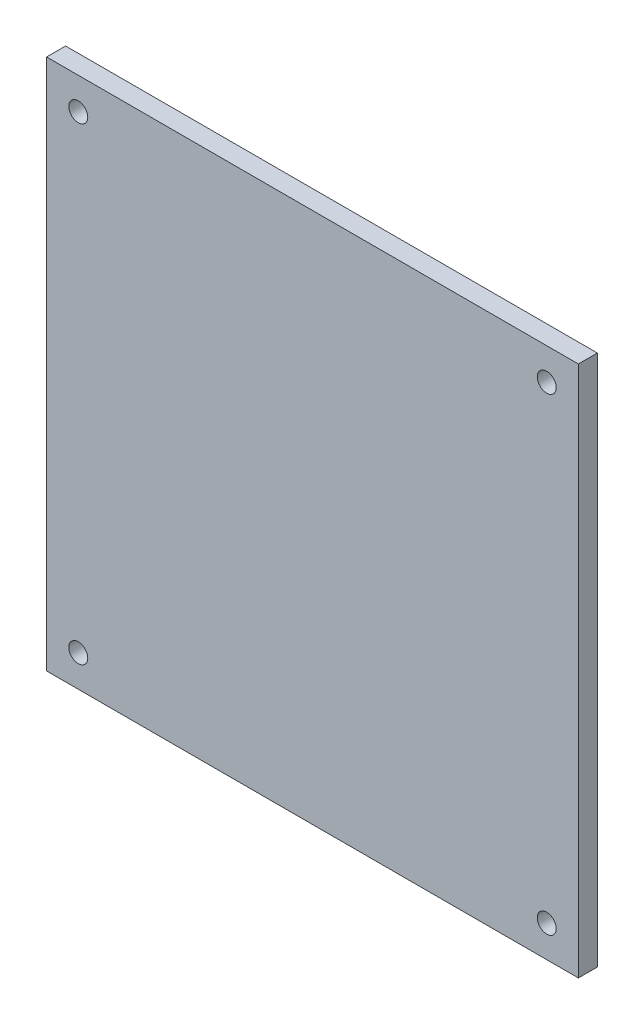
from build123d import *

# Parameters (mm, degrees)
SKETCH1_W           = 84
SKETCH1_H           = 84
SKETCH1_R           = 1.5
BOSS_EXTRUDE1_DEPTH = 3
SKETCH3_R           = 1.5875
CUT_EXTRUDE1_DEPTH  = 1


with BuildPart() as part:
    # Sketch1 → Boss-Extrude1 (new body)
    with BuildSketch(Plane.XY):
        Rectangle(SKETCH1_W, SKETCH1_H)
        with Locations((-37, 37)):
            Circle(SKETCH1_R, mode=Mode.SUBTRACT)
        with Locations((37, 37)):
            Circle(SKETCH1_R, mode=Mode.SUBTRACT)
        with Locations((37, -37)):
            Circle(SKETCH1_R, mode=Mode.SUBTRACT)
        with Locations((-37, -37)):
            Circle(SKETCH1_R, mode=Mode.SUBTRACT)
    extrude(amount=BOSS_EXTRUDE1_DEPTH)

    # Sketch3 → Cut-Extrude1 (cut)
    with BuildSketch(Plane(origin=(0, 0, 0), x_dir=(-1, 0, 0), z_dir=(0, 0, -1))):
        with Locations((19.05, 33.02)):
            Circle(SKETCH3_R)
        with Locations((-8.89, 33.02)):
            Circle(SKETCH3_R)
        with Locations((24.13, -19.05)):
            Circle(SKETCH3_R)
        with Locations((-24.13, -17.78)):
            Circle(SKETCH3_R)
    extrude(amount=-CUT_EXTRUDE1_DEPTH, mode=Mode.SUBTRACT)


solid = part.part
